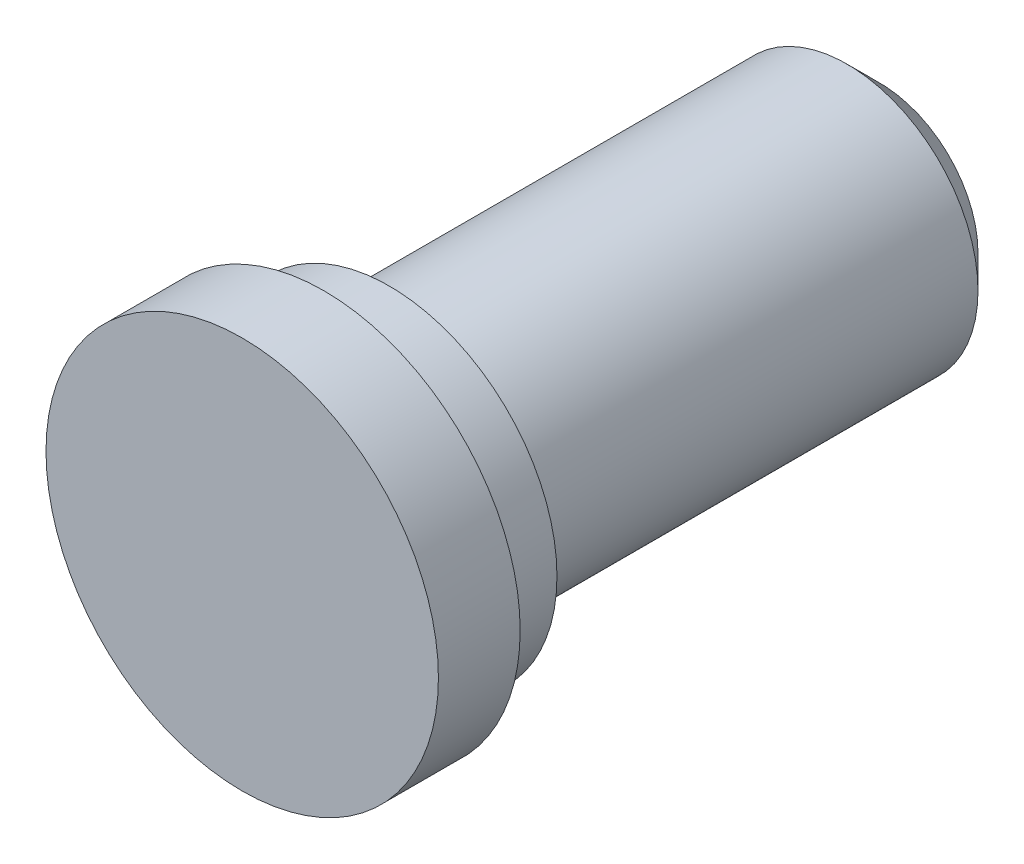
ISO-10303-21;
HEADER;
FILE_DESCRIPTION(('STEP AP214'),'2;1');
FILE_NAME('part.step','',(''),(''),'','','');
FILE_SCHEMA(('AUTOMOTIVE_DESIGN { 1 0 10303 214 1 1 1 1 }'));
ENDSEC;
DATA;
#1=APPLICATION_CONTEXT('core data for automotive mechanical design processes');
#2=APPLICATION_PROTOCOL_DEFINITION('international standard','automotive_design',2000,#1);
#3=PRODUCT_CONTEXT('',#1,'mechanical');
#4=PRODUCT('Part','Part','',(#3));
#5=PRODUCT_RELATED_PRODUCT_CATEGORY('part','',(#4));
#6=PRODUCT_DEFINITION_FORMATION('','',#4);
#7=PRODUCT_DEFINITION_CONTEXT('part definition',#1,'design');
#8=PRODUCT_DEFINITION('design','',#6,#7);
#9=PRODUCT_DEFINITION_SHAPE('','',#8);
#10=(LENGTH_UNIT() NAMED_UNIT(*) SI_UNIT(.MILLI.,.METRE.));
#11=(NAMED_UNIT(*) PLANE_ANGLE_UNIT() SI_UNIT($,.RADIAN.));
#12=(NAMED_UNIT(*) SI_UNIT($,.STERADIAN.) SOLID_ANGLE_UNIT());
#13=UNCERTAINTY_MEASURE_WITH_UNIT(LENGTH_MEASURE(1.E-05),#10,'distance_accuracy_value','');
#14=(GEOMETRIC_REPRESENTATION_CONTEXT(3) GLOBAL_UNCERTAINTY_ASSIGNED_CONTEXT((#13)) GLOBAL_UNIT_ASSIGNED_CONTEXT((#10,
#11,#12)) REPRESENTATION_CONTEXT('',''));
#15=CARTESIAN_POINT('',(0.,0.,0.));
#16=DIRECTION('',(0.,0.,1.));
#17=DIRECTION('',(1.,0.,0.));
#18=AXIS2_PLACEMENT_3D('',#15,#16,#17);
#19=CARTESIAN_POINT('',(10.2499999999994,0.,-3.99999999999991));
#20=DIRECTION('',(0.,0.,1.));
#21=DIRECTION('',(-1.,0.,0.));
#22=AXIS2_PLACEMENT_3D('',#19,#20,#21);
#23=PLANE('',#22);
#24=CARTESIAN_POINT('',(0.,0.,-3.99999999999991));
#25=DIRECTION('',(0.,0.,1.));
#26=DIRECTION('',(-1.,0.,0.));
#27=AXIS2_PLACEMENT_3D('',#24,#25,#26);
#28=CIRCLE('',#27,10.2499999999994);
#29=CARTESIAN_POINT('',(-10.2499999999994,0.,-3.99999999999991));
#30=VERTEX_POINT('',#29);
#31=EDGE_CURVE('E23',#30,#30,#28,.T.);
#32=ORIENTED_EDGE('',*,*,#31,.F.);
#33=EDGE_LOOP('',(#32));
#34=FACE_BOUND('',#33,.T.);
#35=CARTESIAN_POINT('',(0.,0.,-3.99999999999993));
#36=DIRECTION('',(0.,0.,1.));
#37=DIRECTION('',(-1.,0.,0.));
#38=AXIS2_PLACEMENT_3D('',#35,#36,#37);
#39=CIRCLE('',#38,7.99999999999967);
#40=CARTESIAN_POINT('',(-7.99999999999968,0.,-3.99999999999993));
#41=VERTEX_POINT('',#40);
#42=EDGE_CURVE('E38',#41,#41,#39,.T.);
#43=ORIENTED_EDGE('',*,*,#42,.T.);
#44=EDGE_LOOP('',(#43));
#45=FACE_BOUND('',#44,.T.);
#46=ADVANCED_FACE('F12',(#34,#45),#23,.F.);
#47=CARTESIAN_POINT('',(0.,0.,10.));
#48=DIRECTION('',(0.,0.,1.));
#49=DIRECTION('',(-1.,0.,0.));
#50=AXIS2_PLACEMENT_3D('',#47,#48,#49);
#51=CYLINDRICAL_SURFACE('',#50,10.2499999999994);
#52=CARTESIAN_POINT('',(0.,0.,0.));
#53=DIRECTION('',(0.,0.,1.));
#54=DIRECTION('',(-1.,0.,0.));
#55=AXIS2_PLACEMENT_3D('',#52,#53,#54);
#56=CIRCLE('',#55,10.2499999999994);
#57=CARTESIAN_POINT('',(-10.2499999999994,0.,0.));
#58=VERTEX_POINT('',#57);
#59=EDGE_CURVE('E27',#58,#58,#56,.T.);
#60=ORIENTED_EDGE('',*,*,#59,.F.);
#61=EDGE_LOOP('',(#60));
#62=FACE_BOUND('',#61,.T.);
#63=ORIENTED_EDGE('',*,*,#31,.T.);
#64=EDGE_LOOP('',(#63));
#65=FACE_BOUND('',#64,.T.);
#66=ADVANCED_FACE('F57',(#62,#65),#51,.T.);
#67=CARTESIAN_POINT('',(10.2499999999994,0.,1.0082637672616E-13));
#68=DIRECTION('',(0.,0.,1.));
#69=DIRECTION('',(-1.,0.,0.));
#70=AXIS2_PLACEMENT_3D('',#67,#68,#69);
#71=PLANE('',#70);
#72=CARTESIAN_POINT('',(0.,0.,1.09287578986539E-13));
#73=DIRECTION('',(0.,0.,1.));
#74=DIRECTION('',(-1.,0.,0.));
#75=AXIS2_PLACEMENT_3D('',#72,#73,#74);
#76=CIRCLE('',#75,12.);
#77=CARTESIAN_POINT('',(-12.,0.,1.09287578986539E-13));
#78=VERTEX_POINT('',#77);
#79=EDGE_CURVE('E32',#78,#78,#76,.T.);
#80=ORIENTED_EDGE('',*,*,#79,.F.);
#81=EDGE_LOOP('',(#80));
#82=FACE_BOUND('',#81,.T.);
#83=ORIENTED_EDGE('',*,*,#59,.T.);
#84=EDGE_LOOP('',(#83));
#85=FACE_BOUND('',#84,.T.);
#86=ADVANCED_FACE('F63',(#82,#85),#71,.F.);
#87=CARTESIAN_POINT('',(0.,0.,10.));
#88=DIRECTION('',(0.,0.,1.));
#89=DIRECTION('',(-1.,0.,0.));
#90=AXIS2_PLACEMENT_3D('',#87,#88,#89);
#91=CYLINDRICAL_SURFACE('',#90,12.);
#92=CARTESIAN_POINT('',(0.,0.,5.00000000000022));
#93=DIRECTION('',(0.,0.,1.));
#94=DIRECTION('',(-1.,0.,0.));
#95=AXIS2_PLACEMENT_3D('',#92,#93,#94);
#96=CIRCLE('',#95,11.9999999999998);
#97=CARTESIAN_POINT('',(-11.9999999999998,0.,5.00000000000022));
#98=VERTEX_POINT('',#97);
#99=EDGE_CURVE('E35',#98,#98,#96,.T.);
#100=ORIENTED_EDGE('',*,*,#99,.F.);
#101=EDGE_LOOP('',(#100));
#102=FACE_BOUND('',#101,.T.);
#103=ORIENTED_EDGE('',*,*,#79,.T.);
#104=EDGE_LOOP('',(#103));
#105=FACE_BOUND('',#104,.T.);
#106=ADVANCED_FACE('F70',(#102,#105),#91,.T.);
#107=CARTESIAN_POINT('',(0.,0.,5.00000000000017));
#108=DIRECTION('',(0.,0.,-1.));
#109=DIRECTION('',(1.,0.,0.));
#110=AXIS2_PLACEMENT_3D('',#107,#108,#109);
#111=PLANE('',#110);
#112=ORIENTED_EDGE('',*,*,#99,.T.);
#113=EDGE_LOOP('',(#112));
#114=FACE_BOUND('',#113,.T.);
#115=ADVANCED_FACE('F54',(#114),#111,.F.);
#116=CARTESIAN_POINT('',(8.,0.,-34.));
#117=DIRECTION('',(0.,0.,1.));
#118=DIRECTION('',(-1.,0.,0.));
#119=AXIS2_PLACEMENT_3D('',#116,#117,#118);
#120=PLANE('',#119);
#121=CARTESIAN_POINT('',(0.,0.,-34.));
#122=DIRECTION('',(0.,0.,1.));
#123=DIRECTION('',(1.,0.,0.));
#124=AXIS2_PLACEMENT_3D('',#121,#122,#123);
#125=CIRCLE('',#124,6.);
#126=CARTESIAN_POINT('',(5.99999999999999,0.,-34.));
#127=VERTEX_POINT('',#126);
#128=EDGE_CURVE('E8',#127,#127,#125,.F.);
#129=ORIENTED_EDGE('',*,*,#128,.T.);
#130=EDGE_LOOP('',(#129));
#131=FACE_BOUND('',#130,.T.);
#132=ADVANCED_FACE('F45',(#131),#120,.F.);
#133=CARTESIAN_POINT('',(0.,0.,10.));
#134=DIRECTION('',(0.,0.,1.));
#135=DIRECTION('',(-1.,0.,0.));
#136=AXIS2_PLACEMENT_3D('',#133,#134,#135);
#137=CYLINDRICAL_SURFACE('',#136,7.99999999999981);
#138=CARTESIAN_POINT('',(0.,0.,-32.));
#139=DIRECTION('',(0.,0.,1.));
#140=DIRECTION('',(1.,0.,0.));
#141=AXIS2_PLACEMENT_3D('',#138,#139,#140);
#142=CIRCLE('',#141,7.99999999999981);
#143=CARTESIAN_POINT('',(7.9999999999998,0.,-32.));
#144=VERTEX_POINT('',#143);
#145=EDGE_CURVE('E19',#144,#144,#142,.T.);
#146=ORIENTED_EDGE('',*,*,#145,.T.);
#147=EDGE_LOOP('',(#146));
#148=FACE_BOUND('',#147,.T.);
#149=ORIENTED_EDGE('',*,*,#42,.F.);
#150=EDGE_LOOP('',(#149));
#151=FACE_BOUND('',#150,.T.);
#152=ADVANCED_FACE('F43',(#148,#151),#137,.T.);
#153=CARTESIAN_POINT('',(0.,0.,-32.));
#154=DIRECTION('',(0.,0.,1.));
#155=DIRECTION('',(1.,0.,0.));
#156=AXIS2_PLACEMENT_3D('',#153,#154,#155);
#157=CONICAL_SURFACE('',#156,7.99999999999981,0.78539816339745);
#158=ORIENTED_EDGE('',*,*,#128,.F.);
#159=EDGE_LOOP('',(#158));
#160=FACE_BOUND('',#159,.T.);
#161=ORIENTED_EDGE('',*,*,#145,.F.);
#162=EDGE_LOOP('',(#161));
#163=FACE_BOUND('',#162,.T.);
#164=ADVANCED_FACE('F14',(#160,#163),#157,.T.);
#165=CLOSED_SHELL('',(#46,#66,#86,#106,#115,#132,#152,#164));
#166=MANIFOLD_SOLID_BREP('B1',#165);
#167=ADVANCED_BREP_SHAPE_REPRESENTATION('',(#18,#166),#14);
#168=SHAPE_DEFINITION_REPRESENTATION(#9,#167);
ENDSEC;
END-ISO-10303-21;
